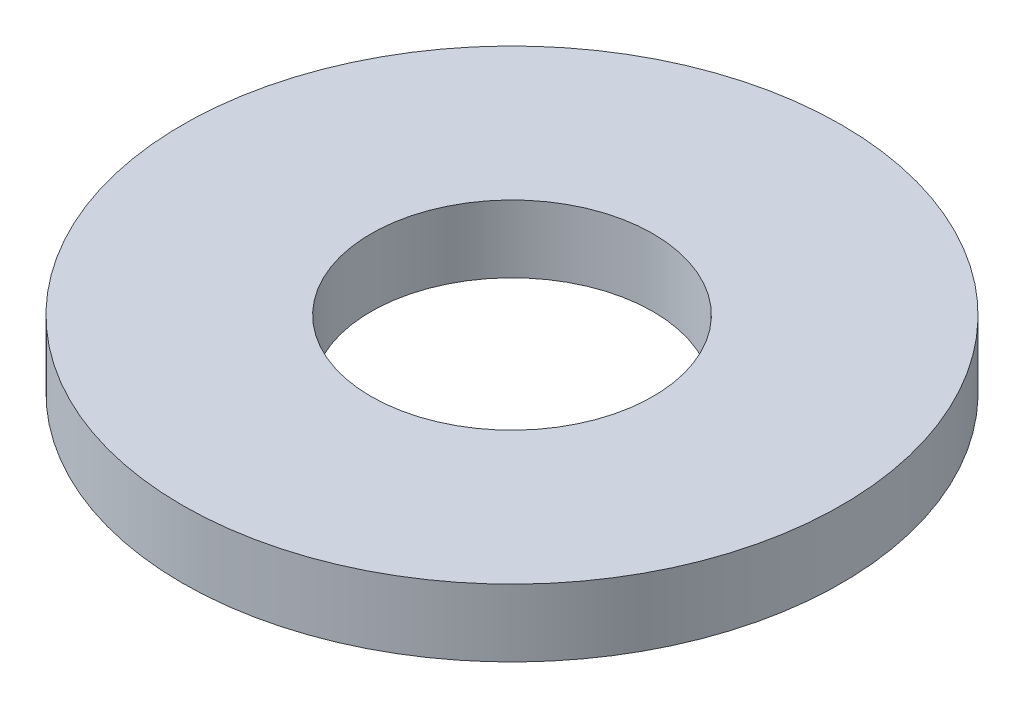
from build123d import *


with BuildPart() as part:
    # Sketch1 → Revolve1 (revolve)
    with BuildSketch(Plane.XY, mode=Mode.PRIVATE) as revolve1_sk:
        Polygon((-11.7602, 0), (-9.5631, 0), (-9.5631, 4.572), (-22.352, 4.572), (-22.352, 0), (-13.9192, 0), (-13.9192, 1.805747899), (-11.7602, 1.805747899), align=None)
    revolve(revolve1_sk.sketch.rotate(Axis((0, 0, 0), (0, 1, 0)), 270), axis=Axis((0, 0, 0), (0, 1, 0)))


solid = part.part
